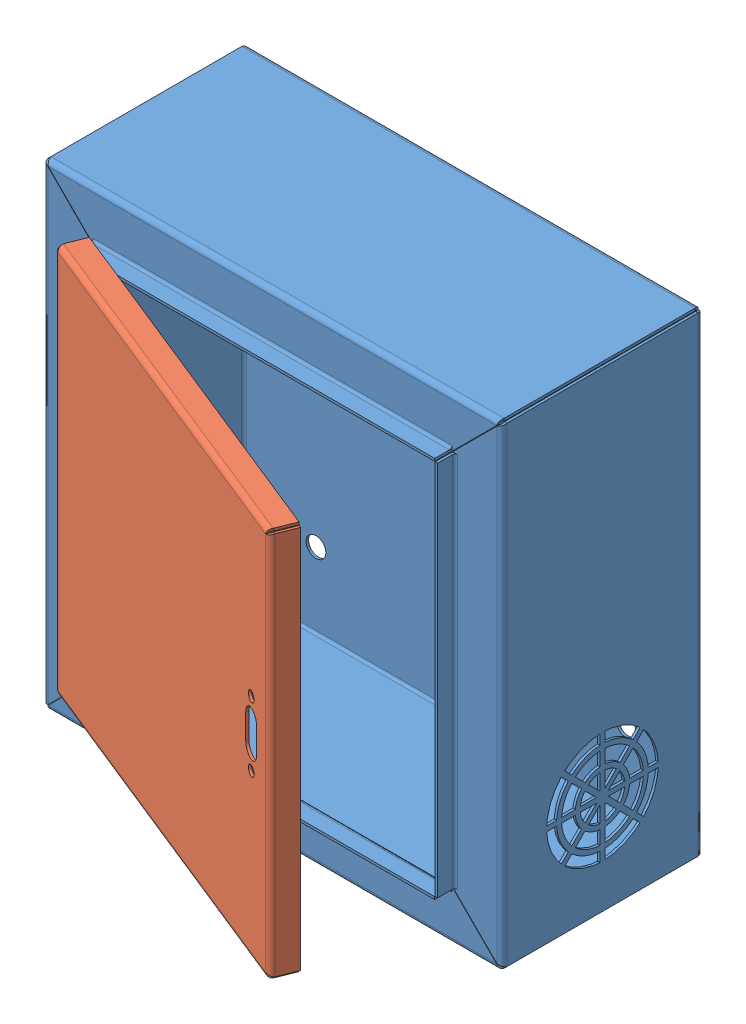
SolidWorks assembly Electrical Enclousure.SLDASM, configuration Default (file format 15000). Lengths in mm.
Overall size (185.01 192 148.21).
2 component instances, 2 part files, 2 mates.
Components (placement in the parent):
- BODY-1: BODY.SLDPRT [Default] at (126.769 94.9149 85.4841) size (185.01 192 88)
- DOOR-1: DOOR.SLDPRT [Default] at (120.789 94.4149 202.7971) x (-0.927532 0 -0.373744) z (0.373744 0 -0.927532) size (155 157 10)
Mates (geometry in assembly coordinates):
- Coincident1: coincident aligned: line of BODY-1 through (52.269 170.7734 165.4841) axis (0 -1 0); line of DOOR-1 through (52.269 171.7734 165.4841) axis (0 -1 0)
- Coincident2: coincident anti-aligned: plane of BODY-1 through (126.769 171.9149 85.4841) normal (0 1 0); plane of DOOR-1 through (120.789 171.9149 202.7971) normal (0 -1 0)
